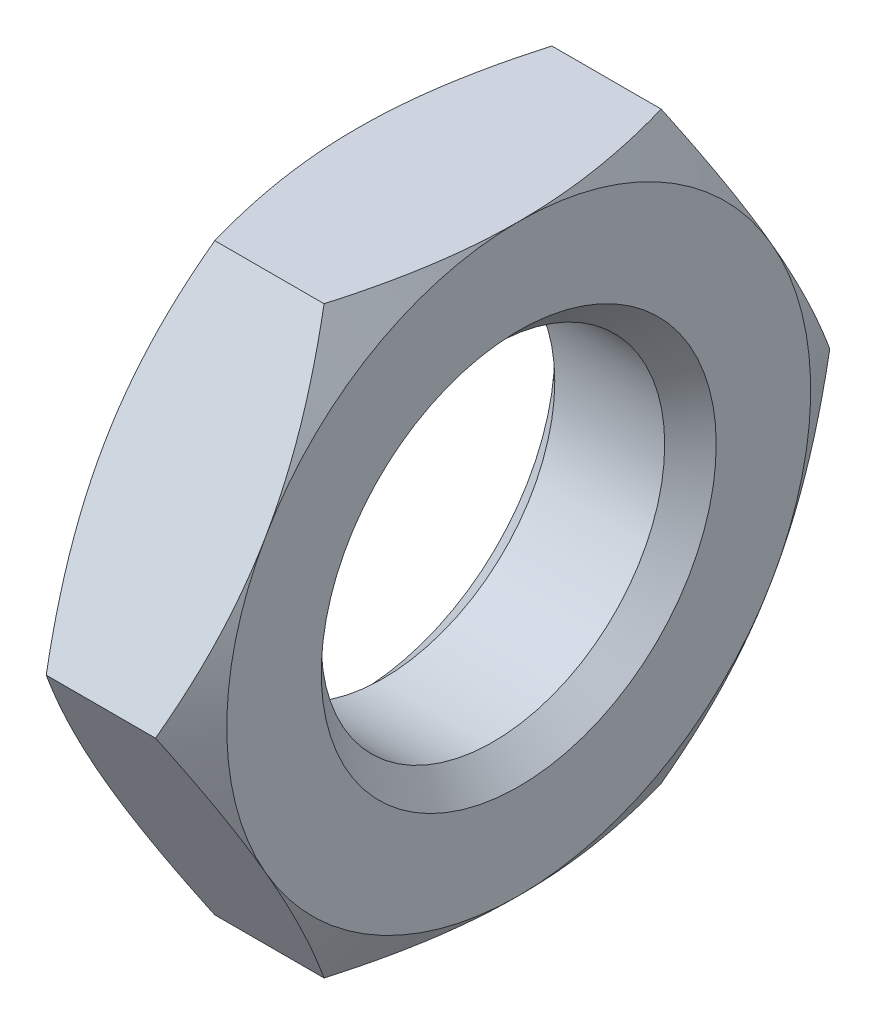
from build123d import *

# Parameters (mm, degrees)
SKETCH1_R      = 5
EXTRUDE1_DEPTH = 4.7
CHAMFER1_SIZE  = 0.75


with BuildPart() as part:
    # Sketch1 → Extrude1 (new body)
    with BuildSketch(Plane(origin=(0, 0, 0), x_dir=(0, 0, -1), z_dir=(1, 0, 0))):
        Polygon((4.907477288, 8.5), (-4.907477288, 8.5), (-9.814954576, 0), (-4.907477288, -8.5), (4.907477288, -8.5), (9.814954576, 0), align=None)
        Circle(SKETCH1_R, mode=Mode.SUBTRACT)
    extrude(amount=EXTRUDE1_DEPTH)

    # Sketch2 → Cut-Revolve1 (revolve, cut)
    with BuildSketch(Plane.XY):
        Polygon((4.7, 8.5), (4.7, 34), (0, 34), (0, 8.5), (2.35, 12.570319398), align=None)
    revolve(axis=Axis((4.7, 0, 0), (-1, 0, 0)), mode=Mode.SUBTRACT)

    # Chamfer1
    chamfer1_edges = [part.edges().sort_by_distance(p)[0] for p in [
        (0, 0, 5),
        (4.7, 0, 5),
    ]]
    chamfer(chamfer1_edges, length=CHAMFER1_SIZE)


solid = part.part
